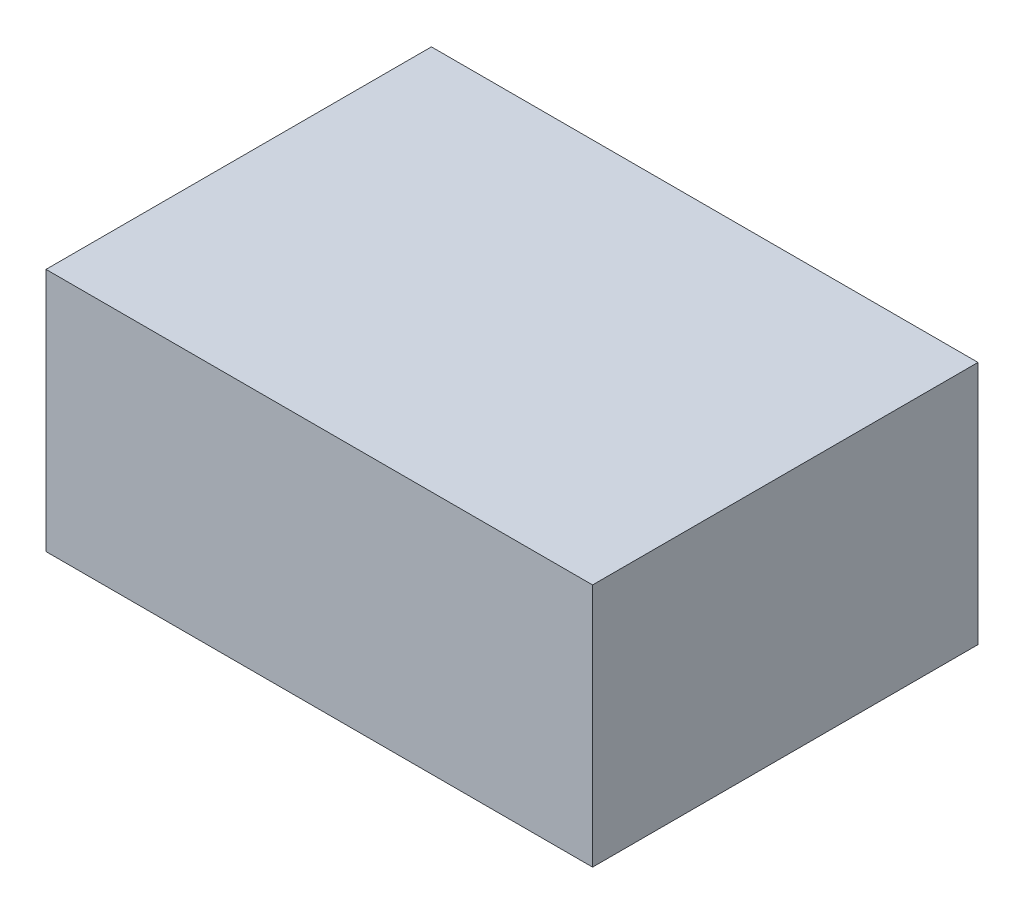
ISO-10303-21;
HEADER;
FILE_DESCRIPTION(('STEP AP214'),'2;1');
FILE_NAME('part.step','',(''),(''),'','','');
FILE_SCHEMA(('AUTOMOTIVE_DESIGN { 1 0 10303 214 1 1 1 1 }'));
ENDSEC;
DATA;
#1=APPLICATION_CONTEXT('core data for automotive mechanical design processes');
#2=APPLICATION_PROTOCOL_DEFINITION('international standard','automotive_design',2000,#1);
#3=PRODUCT_CONTEXT('',#1,'mechanical');
#4=PRODUCT('Part','Part','',(#3));
#5=PRODUCT_RELATED_PRODUCT_CATEGORY('part','',(#4));
#6=PRODUCT_DEFINITION_FORMATION('','',#4);
#7=PRODUCT_DEFINITION_CONTEXT('part definition',#1,'design');
#8=PRODUCT_DEFINITION('design','',#6,#7);
#9=PRODUCT_DEFINITION_SHAPE('','',#8);
#10=(LENGTH_UNIT() NAMED_UNIT(*) SI_UNIT(.MILLI.,.METRE.));
#11=(NAMED_UNIT(*) PLANE_ANGLE_UNIT() SI_UNIT($,.RADIAN.));
#12=(NAMED_UNIT(*) SI_UNIT($,.STERADIAN.) SOLID_ANGLE_UNIT());
#13=UNCERTAINTY_MEASURE_WITH_UNIT(LENGTH_MEASURE(1.E-05),#10,'distance_accuracy_value','');
#14=(GEOMETRIC_REPRESENTATION_CONTEXT(3) GLOBAL_UNCERTAINTY_ASSIGNED_CONTEXT((#13)) GLOBAL_UNIT_ASSIGNED_CONTEXT((#10,
#11,#12)) REPRESENTATION_CONTEXT('',''));
#15=CARTESIAN_POINT('',(0.,0.,0.));
#16=DIRECTION('',(0.,0.,1.));
#17=DIRECTION('',(1.,0.,0.));
#18=AXIS2_PLACEMENT_3D('',#15,#16,#17);
#19=CARTESIAN_POINT('',(51.689,46.228,36.449));
#20=DIRECTION('',(-1.,0.,0.));
#21=DIRECTION('',(0.,0.,1.));
#22=AXIS2_PLACEMENT_3D('',#19,#20,#21);
#23=PLANE('',#22);
#24=DIRECTION('',(0.,0.,-1.));
#25=VECTOR('',#24,1.);
#26=CARTESIAN_POINT('',(51.689,0.,36.449));
#27=LINE('',#26,#25);
#28=CARTESIAN_POINT('',(51.689,0.,36.449));
#29=VERTEX_POINT('',#28);
#30=CARTESIAN_POINT('',(51.689,0.,-36.449));
#31=VERTEX_POINT('',#30);
#32=EDGE_CURVE('E94',#29,#31,#27,.T.);
#33=ORIENTED_EDGE('',*,*,#32,.T.);
#34=DIRECTION('',(0.,-1.,0.));
#35=VECTOR('',#34,1.);
#36=CARTESIAN_POINT('',(51.689,46.228,-36.449));
#37=LINE('',#36,#35);
#38=CARTESIAN_POINT('',(51.689,46.228,-36.449));
#39=VERTEX_POINT('',#38);
#40=EDGE_CURVE('E11',#39,#31,#37,.T.);
#41=ORIENTED_EDGE('',*,*,#40,.F.);
#42=DIRECTION('',(0.,0.,-1.));
#43=VECTOR('',#42,1.);
#44=CARTESIAN_POINT('',(51.689,46.228,36.449));
#45=LINE('',#44,#43);
#46=CARTESIAN_POINT('',(51.689,46.228,36.449));
#47=VERTEX_POINT('',#46);
#48=EDGE_CURVE('E82',#47,#39,#45,.T.);
#49=ORIENTED_EDGE('',*,*,#48,.F.);
#50=DIRECTION('',(0.,-1.,0.));
#51=VECTOR('',#50,1.);
#52=CARTESIAN_POINT('',(51.689,46.228,36.449));
#53=LINE('',#52,#51);
#54=EDGE_CURVE('E90',#47,#29,#53,.T.);
#55=ORIENTED_EDGE('',*,*,#54,.T.);
#56=EDGE_LOOP('',(#33,#41,#49,#55));
#57=FACE_BOUND('',#56,.T.);
#58=ADVANCED_FACE('F31',(#57),#23,.F.);
#59=CARTESIAN_POINT('',(-51.689,46.228,-36.449));
#60=DIRECTION('',(0.,0.,1.));
#61=DIRECTION('',(1.,0.,0.));
#62=AXIS2_PLACEMENT_3D('',#59,#60,#61);
#63=PLANE('',#62);
#64=DIRECTION('',(-1.,0.,0.));
#65=VECTOR('',#64,1.);
#66=CARTESIAN_POINT('',(-51.689,0.,-36.449));
#67=LINE('',#66,#65);
#68=CARTESIAN_POINT('',(-51.689,0.,-36.449));
#69=VERTEX_POINT('',#68);
#70=EDGE_CURVE('E86',#31,#69,#67,.T.);
#71=ORIENTED_EDGE('',*,*,#70,.T.);
#72=DIRECTION('',(0.,-1.,0.));
#73=VECTOR('',#72,1.);
#74=CARTESIAN_POINT('',(-51.689,46.228,-36.449));
#75=LINE('',#74,#73);
#76=CARTESIAN_POINT('',(-51.689,46.228,-36.449));
#77=VERTEX_POINT('',#76);
#78=EDGE_CURVE('E39',#77,#69,#75,.T.);
#79=ORIENTED_EDGE('',*,*,#78,.F.);
#80=DIRECTION('',(-1.,0.,0.));
#81=VECTOR('',#80,1.);
#82=CARTESIAN_POINT('',(-51.689,46.228,-36.449));
#83=LINE('',#82,#81);
#84=EDGE_CURVE('E77',#39,#77,#83,.T.);
#85=ORIENTED_EDGE('',*,*,#84,.F.);
#86=ORIENTED_EDGE('',*,*,#40,.T.);
#87=EDGE_LOOP('',(#71,#79,#85,#86));
#88=FACE_BOUND('',#87,.T.);
#89=ADVANCED_FACE('F85',(#88),#63,.F.);
#90=CARTESIAN_POINT('',(-51.689,46.228,36.449));
#91=DIRECTION('',(1.,0.,0.));
#92=DIRECTION('',(0.,0.,-1.));
#93=AXIS2_PLACEMENT_3D('',#90,#91,#92);
#94=PLANE('',#93);
#95=DIRECTION('',(0.,0.,1.));
#96=VECTOR('',#95,1.);
#97=CARTESIAN_POINT('',(-51.689,0.,36.449));
#98=LINE('',#97,#96);
#99=CARTESIAN_POINT('',(-51.689,0.,36.449));
#100=VERTEX_POINT('',#99);
#101=EDGE_CURVE('E64',#69,#100,#98,.T.);
#102=ORIENTED_EDGE('',*,*,#101,.T.);
#103=DIRECTION('',(0.,-1.,0.));
#104=VECTOR('',#103,1.);
#105=CARTESIAN_POINT('',(-51.689,46.228,36.449));
#106=LINE('',#105,#104);
#107=CARTESIAN_POINT('',(-51.689,46.228,36.449));
#108=VERTEX_POINT('',#107);
#109=EDGE_CURVE('E87',#108,#100,#106,.T.);
#110=ORIENTED_EDGE('',*,*,#109,.F.);
#111=DIRECTION('',(0.,0.,1.));
#112=VECTOR('',#111,1.);
#113=CARTESIAN_POINT('',(-51.689,46.228,36.449));
#114=LINE('',#113,#112);
#115=EDGE_CURVE('E80',#77,#108,#114,.T.);
#116=ORIENTED_EDGE('',*,*,#115,.F.);
#117=ORIENTED_EDGE('',*,*,#78,.T.);
#118=EDGE_LOOP('',(#102,#110,#116,#117));
#119=FACE_BOUND('',#118,.T.);
#120=ADVANCED_FACE('F88',(#119),#94,.F.);
#121=CARTESIAN_POINT('',(-51.689,46.228,36.449));
#122=DIRECTION('',(0.,0.,-1.));
#123=DIRECTION('',(-1.,0.,0.));
#124=AXIS2_PLACEMENT_3D('',#121,#122,#123);
#125=PLANE('',#124);
#126=DIRECTION('',(1.,0.,0.));
#127=VECTOR('',#126,1.);
#128=CARTESIAN_POINT('',(-51.689,0.,36.449));
#129=LINE('',#128,#127);
#130=EDGE_CURVE('E70',#100,#29,#129,.T.);
#131=ORIENTED_EDGE('',*,*,#130,.T.);
#132=ORIENTED_EDGE('',*,*,#54,.F.);
#133=DIRECTION('',(1.,0.,0.));
#134=VECTOR('',#133,1.);
#135=CARTESIAN_POINT('',(-51.689,46.228,36.449));
#136=LINE('',#135,#134);
#137=EDGE_CURVE('E47',#108,#47,#136,.T.);
#138=ORIENTED_EDGE('',*,*,#137,.F.);
#139=ORIENTED_EDGE('',*,*,#109,.T.);
#140=EDGE_LOOP('',(#131,#132,#138,#139));
#141=FACE_BOUND('',#140,.T.);
#142=ADVANCED_FACE('F101',(#141),#125,.F.);
#143=CARTESIAN_POINT('',(51.689,46.228,-36.449));
#144=DIRECTION('',(0.,-1.,0.));
#145=DIRECTION('',(0.,0.,-1.));
#146=AXIS2_PLACEMENT_3D('',#143,#144,#145);
#147=PLANE('',#146);
#148=ORIENTED_EDGE('',*,*,#48,.T.);
#149=ORIENTED_EDGE('',*,*,#84,.T.);
#150=ORIENTED_EDGE('',*,*,#115,.T.);
#151=ORIENTED_EDGE('',*,*,#137,.T.);
#152=EDGE_LOOP('',(#148,#149,#150,#151));
#153=FACE_BOUND('',#152,.T.);
#154=ADVANCED_FACE('F78',(#153),#147,.F.);
#155=CARTESIAN_POINT('',(51.689,0.,-36.449));
#156=DIRECTION('',(0.,-1.,0.));
#157=DIRECTION('',(0.,0.,-1.));
#158=AXIS2_PLACEMENT_3D('',#155,#156,#157);
#159=PLANE('',#158);
#160=ORIENTED_EDGE('',*,*,#32,.F.);
#161=ORIENTED_EDGE('',*,*,#130,.F.);
#162=ORIENTED_EDGE('',*,*,#101,.F.);
#163=ORIENTED_EDGE('',*,*,#70,.F.);
#164=EDGE_LOOP('',(#160,#161,#162,#163));
#165=FACE_BOUND('',#164,.T.);
#166=ADVANCED_FACE('F104',(#165),#159,.T.);
#167=CLOSED_SHELL('',(#58,#89,#120,#142,#154,#166));
#168=MANIFOLD_SOLID_BREP('B2',#167);
#169=ADVANCED_BREP_SHAPE_REPRESENTATION('',(#18,#168),#14);
#170=SHAPE_DEFINITION_REPRESENTATION(#9,#169);
ENDSEC;
END-ISO-10303-21;
